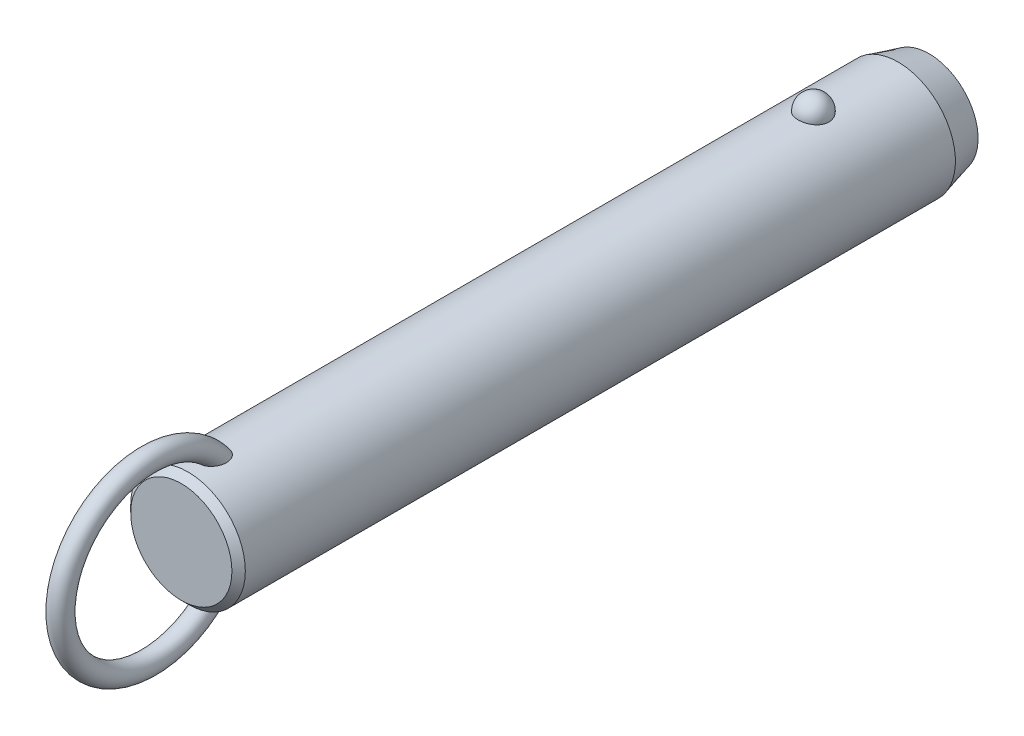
ISO-10303-21;
HEADER;
FILE_DESCRIPTION(('STEP AP214'),'2;1');
FILE_NAME('part.step','',(''),(''),'','','');
FILE_SCHEMA(('AUTOMOTIVE_DESIGN { 1 0 10303 214 1 1 1 1 }'));
ENDSEC;
DATA;
#1=APPLICATION_CONTEXT('core data for automotive mechanical design processes');
#2=APPLICATION_PROTOCOL_DEFINITION('international standard','automotive_design',2000,#1);
#3=PRODUCT_CONTEXT('',#1,'mechanical');
#4=PRODUCT('Part','Part','',(#3));
#5=PRODUCT_RELATED_PRODUCT_CATEGORY('part','',(#4));
#6=PRODUCT_DEFINITION_FORMATION('','',#4);
#7=PRODUCT_DEFINITION_CONTEXT('part definition',#1,'design');
#8=PRODUCT_DEFINITION('design','',#6,#7);
#9=PRODUCT_DEFINITION_SHAPE('','',#8);
#10=(LENGTH_UNIT() NAMED_UNIT(*) SI_UNIT(.MILLI.,.METRE.));
#11=(NAMED_UNIT(*) PLANE_ANGLE_UNIT() SI_UNIT($,.RADIAN.));
#12=(NAMED_UNIT(*) SI_UNIT($,.STERADIAN.) SOLID_ANGLE_UNIT());
#13=UNCERTAINTY_MEASURE_WITH_UNIT(LENGTH_MEASURE(1.E-05),#10,'distance_accuracy_value','');
#14=(GEOMETRIC_REPRESENTATION_CONTEXT(3) GLOBAL_UNCERTAINTY_ASSIGNED_CONTEXT((#13)) GLOBAL_UNIT_ASSIGNED_CONTEXT((#10,
#11,#12)) REPRESENTATION_CONTEXT('',''));
#15=CARTESIAN_POINT('',(0.,0.,0.));
#16=DIRECTION('',(0.,0.,1.));
#17=DIRECTION('',(1.,0.,0.));
#18=AXIS2_PLACEMENT_3D('',#15,#16,#17);
#19=CARTESIAN_POINT('',(0.,0.,106.7));
#20=DIRECTION('',(0.,0.,-1.));
#21=DIRECTION('',(-1.,0.,0.));
#22=AXIS2_PLACEMENT_3D('',#19,#20,#21);
#23=CYLINDRICAL_SURFACE('',#22,11.1);
#24=CARTESIAN_POINT('',(2.9724815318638,10.6945945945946,-3.));
#25=CARTESIAN_POINT('',(2.97247830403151,10.6945972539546,-2.83225059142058));
#26=CARTESIAN_POINT('',(2.95876598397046,10.6984356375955,-2.6644597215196));
#27=CARTESIAN_POINT('',(2.90424529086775,10.7133624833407,-2.33362381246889));
#28=CARTESIAN_POINT('',(2.8634252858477,10.7244540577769,-2.1705808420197));
#29=CARTESIAN_POINT('',(2.75573657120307,10.7526272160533,-1.85396767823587));
#30=CARTESIAN_POINT('',(2.68887937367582,10.7697061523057,-1.70039333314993));
#31=CARTESIAN_POINT('',(2.53079696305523,10.8079438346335,-1.40691598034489));
#32=CARTESIAN_POINT('',(2.43957264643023,10.8291024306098,-1.2670124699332));
#33=CARTESIAN_POINT('',(2.23458150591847,10.8732541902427,-1.00409565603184));
#34=CARTESIAN_POINT('',(2.12071295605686,10.8962553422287,-0.881162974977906));
#35=CARTESIAN_POINT('',(1.87365402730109,10.9414421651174,-0.656352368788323));
#36=CARTESIAN_POINT('',(1.74046358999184,10.9636278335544,-0.554474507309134));
#37=CARTESIAN_POINT('',(1.45872188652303,11.0046495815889,-0.374872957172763));
#38=CARTESIAN_POINT('',(1.31021276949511,11.0234944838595,-0.297085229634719));
#39=CARTESIAN_POINT('',(1.00170030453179,11.0557957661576,-0.16752977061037));
#40=CARTESIAN_POINT('',(0.841698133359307,11.0692526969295,-0.115759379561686));
#41=CARTESIAN_POINT('',(0.517607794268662,11.0890932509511,-0.0403925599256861));
#42=CARTESIAN_POINT('',(0.353633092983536,11.0955916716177,-0.0163383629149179));
#43=CARTESIAN_POINT('',(0.02384202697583,11.1011989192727,0.00445177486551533));
#44=CARTESIAN_POINT('',(-0.141974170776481,11.1003084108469,0.00119017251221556));
#45=CARTESIAN_POINT('',(-0.46840517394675,11.0912990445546,-0.0323233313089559));
#46=CARTESIAN_POINT('',(-0.629059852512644,11.0832767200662,-0.0622147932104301));
#47=CARTESIAN_POINT('',(-0.942937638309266,11.0609962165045,-0.147645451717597));
#48=CARTESIAN_POINT('',(-1.09616062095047,11.0467379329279,-0.203185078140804));
#49=CARTESIAN_POINT('',(-1.39181061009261,11.0134071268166,-0.3387529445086));
#50=CARTESIAN_POINT('',(-1.53417383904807,10.9943086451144,-0.418913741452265));
#51=CARTESIAN_POINT('',(-1.80342160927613,10.9533667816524,-0.601448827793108));
#52=CARTESIAN_POINT('',(-1.9303046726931,10.9315231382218,-0.703825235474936));
#53=CARTESIAN_POINT('',(-2.16747598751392,10.887005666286,-0.930091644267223));
#54=CARTESIAN_POINT('',(-2.27742774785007,10.8643239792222,-1.05433291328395));
#55=CARTESIAN_POINT('',(-2.47517316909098,10.8209886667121,-1.31966633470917));
#56=CARTESIAN_POINT('',(-2.56296538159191,10.8003351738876,-1.46075958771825));
#57=CARTESIAN_POINT('',(-2.71500300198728,10.7631304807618,-1.75753646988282));
#58=CARTESIAN_POINT('',(-2.77898901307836,10.7466250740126,-1.9133588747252));
#59=CARTESIAN_POINT('',(-2.88046189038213,10.7198747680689,-2.2339152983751));
#60=CARTESIAN_POINT('',(-2.91794947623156,10.709629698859,-2.39864907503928));
#61=CARTESIAN_POINT('',(-2.96537819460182,10.6965949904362,-2.73165170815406));
#62=CARTESIAN_POINT('',(-2.97542891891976,10.693775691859,-2.89990378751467));
#63=CARTESIAN_POINT('',(-2.96804271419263,10.6958279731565,-3.235752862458));
#64=CARTESIAN_POINT('',(-2.95060646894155,10.7006993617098,-3.40334987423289));
#65=CARTESIAN_POINT('',(-2.88883358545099,10.71753912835,-3.73233906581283));
#66=CARTESIAN_POINT('',(-2.84462026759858,10.7294749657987,-3.89375610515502));
#67=CARTESIAN_POINT('',(-2.73050447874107,10.7590797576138,-4.20667949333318));
#68=CARTESIAN_POINT('',(-2.66060103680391,10.7767489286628,-4.35818546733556));
#69=CARTESIAN_POINT('',(-2.49642559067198,10.8159599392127,-4.6478542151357));
#70=CARTESIAN_POINT('',(-2.40203047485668,10.8375211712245,-4.78594458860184));
#71=CARTESIAN_POINT('',(-2.19143488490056,10.8820570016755,-5.0441038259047));
#72=CARTESIAN_POINT('',(-2.07523364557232,10.9050316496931,-5.16417205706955));
#73=CARTESIAN_POINT('',(-1.82361254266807,10.9499219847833,-5.38334833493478));
#74=CARTESIAN_POINT('',(-1.68812945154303,10.9718338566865,-5.48238464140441));
#75=CARTESIAN_POINT('',(-1.40191298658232,11.0120611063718,-5.65618873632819));
#76=CARTESIAN_POINT('',(-1.25118062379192,11.0303767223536,-5.73095813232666));
#77=CARTESIAN_POINT('',(-0.94057074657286,11.0611653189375,-5.85334725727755));
#78=CARTESIAN_POINT('',(-0.780821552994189,11.0737044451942,-5.90127578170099));
#79=CARTESIAN_POINT('',(-0.455204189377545,11.0918598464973,-5.96992976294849));
#80=CARTESIAN_POINT('',(-0.289336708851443,11.0974768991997,-5.99065827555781));
#81=CARTESIAN_POINT('',(0.0406846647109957,11.1011307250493,-6.00418773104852));
#82=CARTESIAN_POINT('',(0.204817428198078,11.099299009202,-5.99747318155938));
#83=CARTESIAN_POINT('',(0.529553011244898,11.088551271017,-5.9574031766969));
#84=CARTESIAN_POINT('',(0.690155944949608,11.0796354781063,-5.92404858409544));
#85=CARTESIAN_POINT('',(1.0027760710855,11.0557204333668,-5.83180084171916));
#86=CARTESIAN_POINT('',(1.15482001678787,11.0407414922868,-5.77299291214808));
#87=CARTESIAN_POINT('',(1.44678373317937,11.0062913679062,-5.63147366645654));
#88=CARTESIAN_POINT('',(1.58670279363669,10.9868199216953,-5.54876095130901));
#89=CARTESIAN_POINT('',(1.8527023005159,10.9451315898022,-5.36027644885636));
#90=CARTESIAN_POINT('',(1.97855158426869,10.9228788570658,-5.25418644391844));
#91=CARTESIAN_POINT('',(2.21080872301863,10.8782509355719,-5.02251354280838));
#92=CARTESIAN_POINT('',(2.31721312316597,10.8558757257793,-4.89692718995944));
#93=CARTESIAN_POINT('',(2.5094551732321,10.8130715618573,-4.62745408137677));
#94=CARTESIAN_POINT('',(2.59493284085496,10.7926798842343,-4.48330448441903));
#95=CARTESIAN_POINT('',(2.740862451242,10.7565495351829,-4.18236358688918));
#96=CARTESIAN_POINT('',(2.80132490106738,10.7408089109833,-4.02557762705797));
#97=CARTESIAN_POINT('',(2.88959070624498,10.7173718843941,-3.72475308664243));
#98=CARTESIAN_POINT('',(2.92062102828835,10.7088950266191,-3.58171216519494));
#99=CARTESIAN_POINT('',(2.96206765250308,10.6975052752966,-3.29245795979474));
#100=CARTESIAN_POINT('',(2.97248434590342,10.6945922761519,-3.14624473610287));
#101=CARTESIAN_POINT('',(2.9724815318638,10.6945945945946,-3.));
#102=B_SPLINE_CURVE_WITH_KNOTS('',3,(#24,#25,#26,#27,#28,#29,#30,#31,#32,#33,#34,#35,#36,#37,
#38,#39,#40,#41,#42,#43,#44,#45,#46,#47,#48,#49,#50,#51,#52,#53,#54,#55,#56,#57,#58,#59,#60,#61,
#62,#63,#64,#65,#66,#67,#68,#69,#70,#71,#72,#73,#74,#75,#76,#77,#78,#79,#80,#81,#82,#83,#84,#85,
#86,#87,#88,#89,#90,#91,#92,#93,#94,#95,#96,#97,#98,#99,#100,#101),.UNSPECIFIED.,.T.,.F.,(4,2,2,
2,2,2,2,2,2,2,2,2,2,2,2,2,2,2,2,2,2,2,2,2,2,2,2,2,2,2,2,2,2,2,2,2,2,2,4),(0.,0.502722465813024,
1.00566079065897,1.50837699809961,2.01107471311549,2.51608392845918,3.02109467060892,
3.52475118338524,4.02835620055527,4.523518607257,5.0186364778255,5.50715297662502,
5.9956776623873,6.48688002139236,6.97812923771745,7.47814366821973,7.9781907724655,
8.48353712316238,8.9888697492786,9.49218093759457,9.99547960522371,10.4964777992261,
10.997494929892,11.5010810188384,12.0046847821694,12.5099796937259,13.0152411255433,
13.5145635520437,14.0138298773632,14.5043200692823,14.9947943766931,15.4836390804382,
15.9725123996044,16.4685040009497,16.9645836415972,17.4686765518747,17.972557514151,
18.410841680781,18.849117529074),.UNSPECIFIED.);
#103=CARTESIAN_POINT('',(2.9724815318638,10.6945945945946,-3.));
#104=VERTEX_POINT('',#103);
#105=EDGE_CURVE('E41',#104,#104,#102,.T.);
#106=ORIENTED_EDGE('',*,*,#105,.T.);
#107=EDGE_LOOP('',(#106));
#108=FACE_BOUND('',#107,.T.);
#109=CARTESIAN_POINT('',(0.,0.,118.1));
#110=DIRECTION('',(0.,0.,1.));
#111=DIRECTION('',(1.,0.,0.));
#112=AXIS2_PLACEMENT_3D('',#109,#110,#111);
#113=CIRCLE('',#112,11.1);
#114=CARTESIAN_POINT('',(11.1,0.,118.1));
#115=VERTEX_POINT('',#114);
#116=EDGE_CURVE('E10',#115,#115,#113,.F.);
#117=ORIENTED_EDGE('',*,*,#116,.T.);
#118=EDGE_LOOP('',(#117));
#119=FACE_BOUND('',#118,.T.);
#120=CARTESIAN_POINT('',(-0.564520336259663,-11.0856356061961,110.357815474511));
#121=CARTESIAN_POINT('',(-0.667202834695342,-11.0804062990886,110.391283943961));
#122=CARTESIAN_POINT('',(-0.766875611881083,-11.0738877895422,110.433835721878));
#123=CARTESIAN_POINT('',(-0.957284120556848,-11.0590576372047,110.535419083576));
#124=CARTESIAN_POINT('',(-1.04801616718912,-11.0507452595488,110.59445742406));
#125=CARTESIAN_POINT('',(-1.21800952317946,-11.0333016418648,110.726529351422));
#126=CARTESIAN_POINT('',(-1.29730805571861,-11.0241732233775,110.799515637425));
#127=CARTESIAN_POINT('',(-1.44337665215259,-11.0060026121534,110.957037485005));
#128=CARTESIAN_POINT('',(-1.51014622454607,-10.9969604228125,111.041573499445));
#129=CARTESIAN_POINT('',(-1.63454620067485,-10.9791841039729,111.225521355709));
#130=CARTESIAN_POINT('',(-1.69127003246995,-10.9705107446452,111.325549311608));
#131=CARTESIAN_POINT('',(-1.78980785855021,-10.9548648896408,111.532790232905));
#132=CARTESIAN_POINT('',(-1.83161214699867,-10.9478935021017,111.640007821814));
#133=CARTESIAN_POINT('',(-1.91557028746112,-10.9335803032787,111.905408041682));
#134=CARTESIAN_POINT('',(-1.95040620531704,-10.9273269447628,112.065980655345));
#135=CARTESIAN_POINT('',(-1.99388326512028,-10.9194709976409,112.390697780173));
#136=CARTESIAN_POINT('',(-2.00248051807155,-10.9178762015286,112.554847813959));
#137=CARTESIAN_POINT('',(-1.99551615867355,-10.9191578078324,112.924650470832));
#138=CARTESIAN_POINT('',(-1.9732206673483,-10.9232807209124,113.130191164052));
#139=CARTESIAN_POINT('',(-1.91529761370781,-10.9335244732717,113.433595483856));
#140=CARTESIAN_POINT('',(-1.8918457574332,-10.9376266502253,113.534088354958));
#141=CARTESIAN_POINT('',(-1.83700674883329,-10.9469720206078,113.732855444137));
#142=CARTESIAN_POINT('',(-1.80562070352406,-10.9522150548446,113.831129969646));
#143=CARTESIAN_POINT('',(-1.73463055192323,-10.9636837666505,114.025914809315));
#144=CARTESIAN_POINT('',(-1.69493416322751,-10.9699202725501,114.122390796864));
#145=CARTESIAN_POINT('',(-1.6074514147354,-10.9830806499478,114.311626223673));
#146=CARTESIAN_POINT('',(-1.55966150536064,-10.9900048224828,114.404384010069));
#147=CARTESIAN_POINT('',(-1.45591812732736,-11.0042280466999,114.584690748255));
#148=CARTESIAN_POINT('',(-1.40000013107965,-11.0115253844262,114.672260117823));
#149=CARTESIAN_POINT('',(-1.27937470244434,-11.0261911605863,114.841029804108));
#150=CARTESIAN_POINT('',(-1.21467835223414,-11.033559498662,114.92223795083));
#151=CARTESIAN_POINT('',(-1.08218150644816,-11.0473027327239,115.069001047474));
#152=CARTESIAN_POINT('',(-1.01522633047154,-11.0537063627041,115.135309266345));
#153=CARTESIAN_POINT('',(-0.872952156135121,-11.065850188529,115.258378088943));
#154=CARTESIAN_POINT('',(-0.797642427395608,-11.0715911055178,115.315149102));
#155=CARTESIAN_POINT('',(-0.651396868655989,-11.081071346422,115.407515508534));
#156=CARTESIAN_POINT('',(-0.58171263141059,-11.0849841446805,115.445049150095));
#157=CARTESIAN_POINT('',(-0.437066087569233,-11.0916271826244,115.508259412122));
#158=CARTESIAN_POINT('',(-0.362109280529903,-11.0943586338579,115.533948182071));
#159=CARTESIAN_POINT('',(-0.207828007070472,-11.0983242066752,115.571117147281));
#160=CARTESIAN_POINT('',(-0.128467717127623,-11.0995432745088,115.582454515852));
#161=CARTESIAN_POINT('',(0.030910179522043,-11.1002423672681,115.588965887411));
#162=CARTESIAN_POINT('',(0.110927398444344,-11.0997233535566,115.584148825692));
#163=CARTESIAN_POINT('',(0.256406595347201,-11.097240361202,115.560959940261));
#164=CARTESIAN_POINT('',(0.322235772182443,-11.0955074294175,115.544754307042));
#165=CARTESIAN_POINT('',(0.450635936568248,-11.0910350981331,115.502600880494));
#166=CARTESIAN_POINT('',(0.513205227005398,-11.0882951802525,115.476648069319));
#167=CARTESIAN_POINT('',(0.662626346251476,-11.0805620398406,115.402607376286));
#168=CARTESIAN_POINT('',(0.747127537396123,-11.0751144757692,115.349845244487));
#169=CARTESIAN_POINT('',(0.906756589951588,-11.0631932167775,115.231720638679));
#170=CARTESIAN_POINT('',(0.981859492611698,-11.0567168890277,115.166325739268));
#171=CARTESIAN_POINT('',(1.10712207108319,-11.0447856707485,115.04226337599));
#172=CARTESIAN_POINT('',(1.15909566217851,-11.0394280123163,114.985383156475));
#173=CARTESIAN_POINT('',(1.25791923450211,-11.0286040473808,114.867327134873));
#174=CARTESIAN_POINT('',(1.3047664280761,-11.0231376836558,114.806149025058));
#175=CARTESIAN_POINT('',(1.43818612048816,-11.0068027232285,114.617305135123));
#176=CARTESIAN_POINT('',(1.5175176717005,-10.9960104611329,114.484453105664));
#177=CARTESIAN_POINT('',(1.63597546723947,-10.9788847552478,114.253137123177));
#178=CARTESIAN_POINT('',(1.6798887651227,-10.9722190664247,114.157053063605));
#179=CARTESIAN_POINT('',(1.75953241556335,-10.9597298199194,113.961431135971));
#180=CARTESIAN_POINT('',(1.79525967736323,-10.9539065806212,113.861891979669));
#181=CARTESIAN_POINT('',(1.85844731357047,-10.9433632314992,113.66021118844));
#182=CARTESIAN_POINT('',(1.88591073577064,-10.9386427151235,113.55807052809));
#183=CARTESIAN_POINT('',(1.9323432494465,-10.9305350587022,113.351819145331));
#184=CARTESIAN_POINT('',(1.95131065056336,-10.9271481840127,113.247708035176));
#185=CARTESIAN_POINT('',(1.99040203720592,-10.9201183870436,112.965458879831));
#186=CARTESIAN_POINT('',(2.00221217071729,-10.9179256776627,112.786037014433));
#187=CARTESIAN_POINT('',(1.99711676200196,-10.9188636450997,112.427713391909));
#188=CARTESIAN_POINT('',(1.98026150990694,-10.9219849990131,112.248811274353));
#189=CARTESIAN_POINT('',(1.92151657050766,-10.9324473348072,111.93645144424));
#190=CARTESIAN_POINT('',(1.88605081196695,-10.9386915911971,111.801759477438));
#191=CARTESIAN_POINT('',(1.79393020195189,-10.9541780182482,111.539966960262));
#192=CARTESIAN_POINT('',(1.73729868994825,-10.9634168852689,111.412858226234));
#193=CARTESIAN_POINT('',(1.61237037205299,-10.9824218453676,111.189418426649));
#194=CARTESIAN_POINT('',(1.54715374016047,-10.9918945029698,111.091345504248));
#195=CARTESIAN_POINT('',(1.40127026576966,-11.0114415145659,110.907434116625));
#196=CARTESIAN_POINT('',(1.32060742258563,-11.0215157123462,110.821592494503));
#197=CARTESIAN_POINT('',(1.14474787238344,-11.041168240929,110.665163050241));
#198=CARTESIAN_POINT('',(1.04947805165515,-11.0507437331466,110.594656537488));
#199=CARTESIAN_POINT('',(0.847278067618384,-11.0680789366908,110.472640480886));
#200=CARTESIAN_POINT('',(0.74035174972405,-11.0758392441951,110.421124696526));
#201=CARTESIAN_POINT('',(0.52928931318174,-11.0878275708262,110.343485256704));
#202=CARTESIAN_POINT('',(0.425895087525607,-11.0923259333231,110.315377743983));
#203=CARTESIAN_POINT('',(0.215723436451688,-11.0984001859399,110.277703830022));
#204=CARTESIAN_POINT('',(0.108947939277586,-11.0999777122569,110.268127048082));
#205=CARTESIAN_POINT('',(-0.0938962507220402,-11.1000196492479,110.267877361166));
#206=CARTESIAN_POINT('',(-0.189967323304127,-11.0987797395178,110.275408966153));
#207=CARTESIAN_POINT('',(-0.379657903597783,-11.0939111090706,110.305507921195));
#208=CARTESIAN_POINT('',(-0.473277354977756,-11.0902823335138,110.328075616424));
#209=CARTESIAN_POINT('',(-0.564520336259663,-11.0856356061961,110.357815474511));
#210=B_SPLINE_CURVE_WITH_KNOTS('',3,(#120,#121,#122,#123,#124,#125,#126,#127,#128,#129,#130,
#131,#132,#133,#134,#135,#136,#137,#138,#139,#140,#141,#142,#143,#144,#145,#146,#147,#148,#149,
#150,#151,#152,#153,#154,#155,#156,#157,#158,#159,#160,#161,#162,#163,#164,#165,#166,#167,#168,
#169,#170,#171,#172,#173,#174,#175,#176,#177,#178,#179,#180,#181,#182,#183,#184,#185,#186,#187,
#188,#189,#190,#191,#192,#193,#194,#195,#196,#197,#198,#199,#200,#201,#202,#203,#204,#205,#206,
#207,#208,#209),.UNSPECIFIED.,.T.,.F.,(4,2,2,2,2,2,2,2,2,2,2,2,2,2,2,2,2,2,2,2,2,2,2,2,2,2,2,2,
2,2,2,2,2,2,2,2,2,2,2,2,2,2,2,2,4),(0.,0.323999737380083,0.648132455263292,0.971184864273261,
1.29424994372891,1.6388623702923,1.98369857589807,2.47426059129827,2.96564271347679,
3.58257396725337,3.89215258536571,4.20168803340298,4.51486273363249,4.82817514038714,
5.14015911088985,5.45175282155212,5.73442856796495,6.01679375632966,6.25364580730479,
6.49025437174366,6.72919963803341,6.96801276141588,7.17061258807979,7.37331685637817,
7.6709498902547,7.96935728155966,8.20075067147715,8.43226927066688,8.89581623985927,
9.21306533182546,9.53043400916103,9.84768549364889,10.1650000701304,10.70229304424,
11.2386443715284,11.6553390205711,12.0715755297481,12.4245637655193,12.7774607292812,
13.1321855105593,13.4867936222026,13.8068771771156,14.1267813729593,14.4146787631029,
14.7025827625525),.UNSPECIFIED.);
#211=CARTESIAN_POINT('',(-0.564520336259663,-11.0856356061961,110.357815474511));
#212=VERTEX_POINT('',#211);
#213=EDGE_CURVE('E60',#212,#212,#210,.T.);
#214=ORIENTED_EDGE('',*,*,#213,.T.);
#215=EDGE_LOOP('',(#214));
#216=FACE_BOUND('',#215,.T.);
#217=CARTESIAN_POINT('',(-0.564520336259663,11.0856356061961,110.357815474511));
#218=CARTESIAN_POINT('',(-0.468542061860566,11.0905203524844,110.326545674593));
#219=CARTESIAN_POINT('',(-0.36979381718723,11.0942886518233,110.303157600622));
#220=CARTESIAN_POINT('',(-0.169555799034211,11.0991586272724,110.273085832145));
#221=CARTESIAN_POINT('',(-0.0680604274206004,11.1002543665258,110.26643932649));
#222=CARTESIAN_POINT('',(0.134549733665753,11.099646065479,110.270157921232));
#223=CARTESIAN_POINT('',(0.235664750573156,11.0979441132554,110.28051033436));
#224=CARTESIAN_POINT('',(0.43463240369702,11.0919342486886,110.317831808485));
#225=CARTESIAN_POINT('',(0.53248665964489,11.0876276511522,110.344792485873));
#226=CARTESIAN_POINT('',(0.72244585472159,11.0768742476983,110.4144096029));
#227=CARTESIAN_POINT('',(0.814543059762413,11.0704246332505,110.457086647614));
#228=CARTESIAN_POINT('',(0.990565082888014,11.0560659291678,110.556648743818));
#229=CARTESIAN_POINT('',(1.07448844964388,11.048156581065,110.613536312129));
#230=CARTESIAN_POINT('',(1.23562672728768,11.0313221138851,110.742210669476));
#231=CARTESIAN_POINT('',(1.31242684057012,11.0223686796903,110.814511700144));
#232=CARTESIAN_POINT('',(1.45398030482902,11.0045918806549,110.970042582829));
#233=CARTESIAN_POINT('',(1.51873073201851,10.9957685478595,111.053275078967));
#234=CARTESIAN_POINT('',(1.64107232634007,10.9782087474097,111.236384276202));
#235=CARTESIAN_POINT('',(1.69743176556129,10.9695572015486,111.337089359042));
#236=CARTESIAN_POINT('',(1.79515063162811,10.9539887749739,111.545626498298));
#237=CARTESIAN_POINT('',(1.83649966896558,10.9470730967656,111.65346343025));
#238=CARTESIAN_POINT('',(1.91931148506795,10.9329211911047,111.920399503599));
#239=CARTESIAN_POINT('',(1.95340104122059,10.9267904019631,112.081861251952));
#240=CARTESIAN_POINT('',(1.99526195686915,10.9192174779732,112.40821631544));
#241=CARTESIAN_POINT('',(2.00298989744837,10.9177830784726,112.57311484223));
#242=CARTESIAN_POINT('',(1.99396251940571,10.9194420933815,112.944100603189));
#243=CARTESIAN_POINT('',(1.97050829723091,10.923774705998,113.15003871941));
#244=CARTESIAN_POINT('',(1.91079643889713,10.9343131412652,113.453901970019));
#245=CARTESIAN_POINT('',(1.88673702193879,10.9385106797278,113.554529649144));
#246=CARTESIAN_POINT('',(1.83065508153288,10.9480376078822,113.753510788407));
#247=CARTESIAN_POINT('',(1.79863369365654,10.9533668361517,113.851864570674));
#248=CARTESIAN_POINT('',(1.72633365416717,10.9649954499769,114.046720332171));
#249=CARTESIAN_POINT('',(1.68596409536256,10.9713053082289,114.14318790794));
#250=CARTESIAN_POINT('',(1.5970799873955,10.9845964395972,114.332323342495));
#251=CARTESIAN_POINT('',(1.54856169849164,10.9915780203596,114.424989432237));
#252=CARTESIAN_POINT('',(1.44330168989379,11.0058935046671,114.604975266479));
#253=CARTESIAN_POINT('',(1.38659749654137,11.0132257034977,114.692316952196));
#254=CARTESIAN_POINT('',(1.26431158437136,11.0279330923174,114.860456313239));
#255=CARTESIAN_POINT('',(1.19874160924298,11.0353082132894,114.941262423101));
#256=CARTESIAN_POINT('',(1.06542088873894,11.0489310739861,115.085985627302));
#257=CARTESIAN_POINT('',(0.998640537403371,11.0552153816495,115.150784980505));
#258=CARTESIAN_POINT('',(0.856896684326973,11.0671032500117,115.270846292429));
#259=CARTESIAN_POINT('',(0.781942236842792,11.0727075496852,115.326118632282));
#260=CARTESIAN_POINT('',(0.636276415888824,11.081949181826,115.415972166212));
#261=CARTESIAN_POINT('',(0.5667558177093,11.0857572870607,115.452441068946));
#262=CARTESIAN_POINT('',(0.422602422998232,11.0921860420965,115.513533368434));
#263=CARTESIAN_POINT('',(0.347974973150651,11.0948079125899,115.538168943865));
#264=CARTESIAN_POINT('',(0.194593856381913,11.0985608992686,115.573323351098));
#265=CARTESIAN_POINT('',(0.115807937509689,11.0996777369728,115.583706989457));
#266=CARTESIAN_POINT('',(-0.0422499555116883,11.1002003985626,115.588574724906));
#267=CARTESIAN_POINT('',(-0.121521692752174,11.09960699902,115.583066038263));
#268=CARTESIAN_POINT('',(-0.266046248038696,11.0970123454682,115.558827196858));
#269=CARTESIAN_POINT('',(-0.331661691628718,11.0952283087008,115.542135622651));
#270=CARTESIAN_POINT('',(-0.459588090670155,11.0906663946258,115.499111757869));
#271=CARTESIAN_POINT('',(-0.521897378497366,11.0878880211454,115.472774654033));
#272=CARTESIAN_POINT('',(-0.671446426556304,11.0800342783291,115.397513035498));
#273=CARTESIAN_POINT('',(-0.756250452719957,11.0744969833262,115.343818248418));
#274=CARTESIAN_POINT('',(-0.916349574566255,11.0624045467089,115.223802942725));
#275=CARTESIAN_POINT('',(-0.991618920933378,11.0558467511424,115.157449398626));
#276=CARTESIAN_POINT('',(-1.11713140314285,11.0437783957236,115.031633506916));
#277=CARTESIAN_POINT('',(-1.16920539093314,11.0383619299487,114.973952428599));
#278=CARTESIAN_POINT('',(-1.26817476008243,11.02743010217,114.854280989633));
#279=CARTESIAN_POINT('',(-1.31506731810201,11.0219146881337,114.792288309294));
#280=CARTESIAN_POINT('',(-1.40399813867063,11.0109399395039,114.664784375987));
#281=CARTESIAN_POINT('',(-1.4460286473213,11.0054807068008,114.599267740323));
#282=CARTESIAN_POINT('',(-1.52538779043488,10.9947621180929,114.465422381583));
#283=CARTESIAN_POINT('',(-1.56271516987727,10.9895028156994,114.397092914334));
#284=CARTESIAN_POINT('',(-1.64537943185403,10.9774790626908,114.233210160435));
#285=CARTESIAN_POINT('',(-1.68879497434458,10.9708503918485,114.1366735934));
#286=CARTESIAN_POINT('',(-1.76740738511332,10.9584602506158,113.940236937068));
#287=CARTESIAN_POINT('',(-1.80260120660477,10.95269910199,113.84033561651));
#288=CARTESIAN_POINT('',(-1.86468657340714,10.9423003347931,113.637966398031));
#289=CARTESIAN_POINT('',(-1.8915816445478,10.9376622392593,113.535499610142));
#290=CARTESIAN_POINT('',(-1.93682458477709,10.9297405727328,113.328642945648));
#291=CARTESIAN_POINT('',(-1.9551708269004,10.9264572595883,113.224252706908));
#292=CARTESIAN_POINT('',(-1.99232562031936,10.9197647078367,112.94262876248));
#293=CARTESIAN_POINT('',(-2.00294603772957,10.9177914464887,112.764185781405));
#294=CARTESIAN_POINT('',(-1.99566675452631,10.9191290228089,112.407996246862));
#295=CARTESIAN_POINT('',(-1.97781651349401,10.9224306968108,112.23024902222));
#296=CARTESIAN_POINT('',(-1.91747214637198,10.9331592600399,111.919792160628));
#297=CARTESIAN_POINT('',(-1.88131022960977,10.9395108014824,111.785825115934));
#298=CARTESIAN_POINT('',(-1.78790380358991,10.9551659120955,111.52559757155));
#299=CARTESIAN_POINT('',(-1.7306830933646,10.9644661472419,111.399328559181));
#300=CARTESIAN_POINT('',(-1.60475573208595,10.9835398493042,111.17741565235));
#301=CARTESIAN_POINT('',(-1.53908879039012,10.9930297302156,111.080026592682));
#302=CARTESIAN_POINT('',(-1.39238608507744,11.0125708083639,110.897525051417));
#303=CARTESIAN_POINT('',(-1.31135150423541,11.0226219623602,110.812411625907));
#304=CARTESIAN_POINT('',(-1.14382035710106,11.0411991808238,110.66529943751));
#305=CARTESIAN_POINT('',(-1.05858500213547,11.0497792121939,110.60186930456));
#306=CARTESIAN_POINT('',(-0.878723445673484,11.0655285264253,110.490250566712));
#307=CARTESIAN_POINT('',(-0.784123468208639,11.0727015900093,110.442020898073));
#308=CARTESIAN_POINT('',(-0.646163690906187,11.0812501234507,110.386023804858));
#309=CARTESIAN_POINT('',(-0.605595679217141,11.0835451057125,110.371197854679));
#310=CARTESIAN_POINT('',(-0.564520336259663,11.0856356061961,110.357815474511));
#311=B_SPLINE_CURVE_WITH_KNOTS('',3,(#217,#218,#219,#220,#221,#222,#223,#224,#225,#226,#227,
#228,#229,#230,#231,#232,#233,#234,#235,#236,#237,#238,#239,#240,#241,#242,#243,#244,#245,#246,
#247,#248,#249,#250,#251,#252,#253,#254,#255,#256,#257,#258,#259,#260,#261,#262,#263,#264,#265,
#266,#267,#268,#269,#270,#271,#272,#273,#274,#275,#276,#277,#278,#279,#280,#281,#282,#283,#284,
#285,#286,#287,#288,#289,#290,#291,#292,#293,#294,#295,#296,#297,#298,#299,#300,#301,#302,#303,
#304,#305,#306,#307,#308,#309,#310),.UNSPECIFIED.,.T.,.F.,(4,2,2,2,2,2,2,2,2,2,2,2,2,2,2,2,2,2,
2,2,2,2,2,2,2,2,2,2,2,2,2,2,2,2,2,2,2,2,2,2,2,2,2,2,2,2,4),(0.,0.303061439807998,
0.606795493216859,0.910302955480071,1.21365733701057,1.51741085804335,1.82121821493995,
2.1374520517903,2.45376252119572,2.799586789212,3.14564996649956,3.6383239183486,
4.13180893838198,4.75031912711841,5.06071926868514,5.37107516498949,5.68500772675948,
5.99908475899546,6.31176519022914,6.62403542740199,6.90315673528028,7.1819719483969,
7.41687778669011,7.65154134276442,7.88841587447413,8.12518286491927,8.3275284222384,
8.52997509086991,8.82986421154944,9.13054668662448,9.36393502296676,9.59744991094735,
9.83133221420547,10.0652767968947,10.383032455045,10.7009056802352,11.0186436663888,
11.3364420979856,11.8705925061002,12.4038159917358,12.8189662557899,13.2336487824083,
13.5857049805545,13.9377340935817,14.2561354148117,14.5736690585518,14.7033687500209),.UNSPECIFIED.);
#312=CARTESIAN_POINT('',(-0.564520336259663,11.0856356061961,110.357815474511));
#313=VERTEX_POINT('',#312);
#314=EDGE_CURVE('E67',#313,#313,#311,.T.);
#315=ORIENTED_EDGE('',*,*,#314,.T.);
#316=EDGE_LOOP('',(#315));
#317=FACE_BOUND('',#316,.T.);
#318=CARTESIAN_POINT('',(0.,0.,-19.4000000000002));
#319=DIRECTION('',(0.,0.,-1.));
#320=DIRECTION('',(-1.,0.,0.));
#321=AXIS2_PLACEMENT_3D('',#318,#319,#320);
#322=CIRCLE('',#321,11.1);
#323=CARTESIAN_POINT('',(-11.1,0.,-19.4000000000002));
#324=VERTEX_POINT('',#323);
#325=EDGE_CURVE('E57',#324,#324,#322,.F.);
#326=ORIENTED_EDGE('',*,*,#325,.T.);
#327=EDGE_LOOP('',(#326));
#328=FACE_BOUND('',#327,.T.);
#329=ADVANCED_FACE('F37',(#108,#119,#216,#317,#328),#23,.T.);
#330=CARTESIAN_POINT('',(0.,0.,-25.4));
#331=DIRECTION('',(0.,0.,-1.));
#332=DIRECTION('',(-1.,0.,0.));
#333=AXIS2_PLACEMENT_3D('',#330,#331,#332);
#334=PLANE('',#333);
#335=CARTESIAN_POINT('',(0.,0.,-25.4));
#336=DIRECTION('',(0.,0.,-1.));
#337=DIRECTION('',(-1.,0.,0.));
#338=AXIS2_PLACEMENT_3D('',#335,#336,#337);
#339=CIRCLE('',#338,9.4923048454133);
#340=CARTESIAN_POINT('',(-9.4923048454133,0.,-25.4));
#341=VERTEX_POINT('',#340);
#342=EDGE_CURVE('E66',#341,#341,#339,.T.);
#343=ORIENTED_EDGE('',*,*,#342,.T.);
#344=EDGE_LOOP('',(#343));
#345=FACE_BOUND('',#344,.T.);
#346=ADVANCED_FACE('F85',(#345),#334,.T.);
#347=CARTESIAN_POINT('',(0.,0.,-25.4));
#348=DIRECTION('',(0.,0.,1.));
#349=DIRECTION('',(1.,0.,0.));
#350=AXIS2_PLACEMENT_3D('',#347,#348,#349);
#351=CONICAL_SURFACE('',#350,9.4923048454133,0.261799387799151);
#352=ORIENTED_EDGE('',*,*,#325,.F.);
#353=EDGE_LOOP('',(#352));
#354=FACE_BOUND('',#353,.T.);
#355=ORIENTED_EDGE('',*,*,#342,.F.);
#356=EDGE_LOOP('',(#355));
#357=FACE_BOUND('',#356,.T.);
#358=ADVANCED_FACE('F83',(#354,#357),#351,.T.);
#359=CARTESIAN_POINT('',(0.,0.,119.4));
#360=DIRECTION('',(0.,0.,1.));
#361=DIRECTION('',(1.,0.,0.));
#362=AXIS2_PLACEMENT_3D('',#359,#360,#361);
#363=PLANE('',#362);
#364=CARTESIAN_POINT('',(0.,0.,119.4));
#365=DIRECTION('',(0.,0.,1.));
#366=DIRECTION('',(1.,0.,0.));
#367=AXIS2_PLACEMENT_3D('',#364,#365,#366);
#368=CIRCLE('',#367,9.80000000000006);
#369=CARTESIAN_POINT('',(9.80000000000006,0.,119.4));
#370=VERTEX_POINT('',#369);
#371=EDGE_CURVE('E50',#370,#370,#368,.T.);
#372=ORIENTED_EDGE('',*,*,#371,.T.);
#373=EDGE_LOOP('',(#372));
#374=FACE_BOUND('',#373,.T.);
#375=ADVANCED_FACE('F77',(#374),#363,.T.);
#376=CARTESIAN_POINT('',(0.,0.,125.75));
#377=DIRECTION('',(1.,0.,0.));
#378=DIRECTION('',(0.,0.,-1.));
#379=AXIS2_PLACEMENT_3D('',#376,#377,#378);
#380=TOROIDAL_SURFACE('',#379,17.05,2.);
#381=ORIENTED_EDGE('',*,*,#314,.F.);
#382=EDGE_LOOP('',(#381));
#383=FACE_BOUND('',#382,.T.);
#384=ORIENTED_EDGE('',*,*,#213,.F.);
#385=EDGE_LOOP('',(#384));
#386=FACE_BOUND('',#385,.T.);
#387=ADVANCED_FACE('F73',(#383,#386),#380,.T.);
#388=CARTESIAN_POINT('',(0.,0.,119.4));
#389=DIRECTION('',(0.,0.,-1.));
#390=DIRECTION('',(-1.,0.,0.));
#391=AXIS2_PLACEMENT_3D('',#388,#389,#390);
#392=CONICAL_SURFACE('',#391,9.80000000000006,0.78539816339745);
#393=ORIENTED_EDGE('',*,*,#116,.F.);
#394=EDGE_LOOP('',(#393));
#395=FACE_BOUND('',#394,.T.);
#396=ORIENTED_EDGE('',*,*,#371,.F.);
#397=EDGE_LOOP('',(#396));
#398=FACE_BOUND('',#397,.T.);
#399=ADVANCED_FACE('F39',(#395,#398),#392,.T.);
#400=CARTESIAN_POINT('',(0.,11.1,-3.));
#401=DIRECTION('',(0.,1.,0.));
#402=DIRECTION('',(0.,0.,-1.));
#403=AXIS2_PLACEMENT_3D('',#400,#401,#402);
#404=SPHERICAL_SURFACE('',#403,3.);
#405=ORIENTED_EDGE('',*,*,#105,.F.);
#406=EDGE_LOOP('',(#405));
#407=FACE_BOUND('',#406,.T.);
#408=ADVANCED_FACE('F79',(#407),#404,.T.);
#409=CLOSED_SHELL('',(#329,#346,#358,#375,#387,#399,#408));
#410=MANIFOLD_SOLID_BREP('B2',#409);
#411=ADVANCED_BREP_SHAPE_REPRESENTATION('',(#18,#410),#14);
#412=SHAPE_DEFINITION_REPRESENTATION(#9,#411);
ENDSEC;
END-ISO-10303-21;
